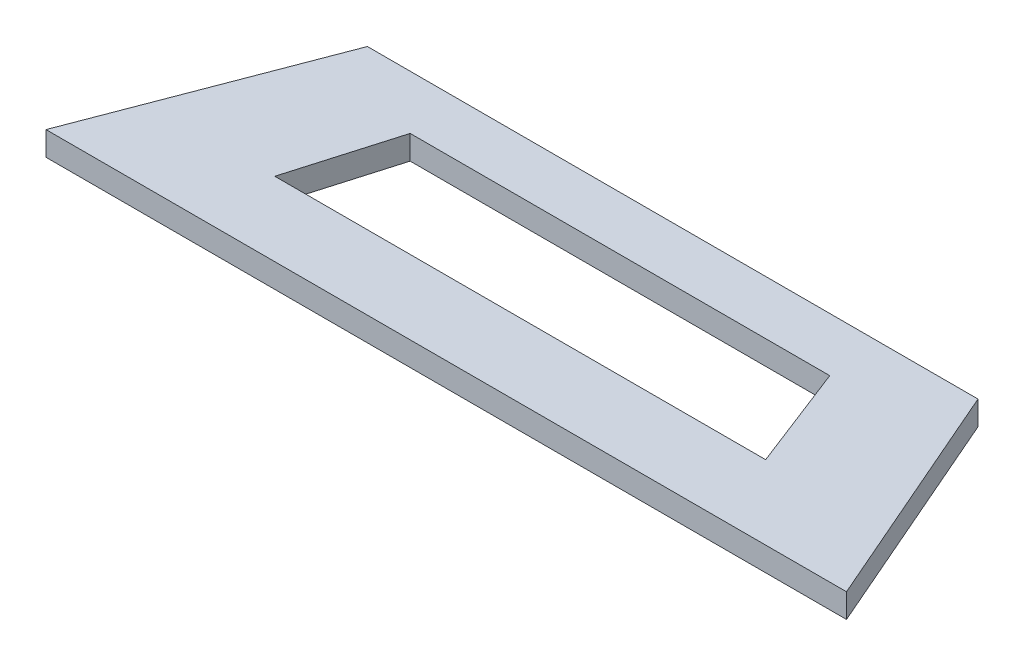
ISO-10303-21;
HEADER;
FILE_DESCRIPTION(('STEP AP214'),'2;1');
FILE_NAME('part.step','',(''),(''),'','','');
FILE_SCHEMA(('AUTOMOTIVE_DESIGN { 1 0 10303 214 1 1 1 1 }'));
ENDSEC;
DATA;
#1=APPLICATION_CONTEXT('core data for automotive mechanical design processes');
#2=APPLICATION_PROTOCOL_DEFINITION('international standard','automotive_design',2000,#1);
#3=PRODUCT_CONTEXT('',#1,'mechanical');
#4=PRODUCT('Part','Part','',(#3));
#5=PRODUCT_RELATED_PRODUCT_CATEGORY('part','',(#4));
#6=PRODUCT_DEFINITION_FORMATION('','',#4);
#7=PRODUCT_DEFINITION_CONTEXT('part definition',#1,'design');
#8=PRODUCT_DEFINITION('design','',#6,#7);
#9=PRODUCT_DEFINITION_SHAPE('','',#8);
#10=(LENGTH_UNIT() NAMED_UNIT(*) SI_UNIT(.MILLI.,.METRE.));
#11=(NAMED_UNIT(*) PLANE_ANGLE_UNIT() SI_UNIT($,.RADIAN.));
#12=(NAMED_UNIT(*) SI_UNIT($,.STERADIAN.) SOLID_ANGLE_UNIT());
#13=UNCERTAINTY_MEASURE_WITH_UNIT(LENGTH_MEASURE(1.E-05),#10,'distance_accuracy_value','');
#14=(GEOMETRIC_REPRESENTATION_CONTEXT(3) GLOBAL_UNCERTAINTY_ASSIGNED_CONTEXT((#13)) GLOBAL_UNIT_ASSIGNED_CONTEXT((#10,
#11,#12)) REPRESENTATION_CONTEXT('',''));
#15=CARTESIAN_POINT('',(0.,0.,0.));
#16=DIRECTION('',(0.,0.,1.));
#17=DIRECTION('',(1.,0.,0.));
#18=AXIS2_PLACEMENT_3D('',#15,#16,#17);
#19=CARTESIAN_POINT('',(11.0888777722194,3.,-29.0626794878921));
#20=DIRECTION('',(0.934301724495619,0.,0.356483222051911));
#21=DIRECTION('',(0.356483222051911,0.,-0.934301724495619));
#22=AXIS2_PLACEMENT_3D('',#19,#20,#21);
#23=PLANE('',#22);
#24=DIRECTION('',(-0.356483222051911,0.,0.934301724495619));
#25=VECTOR('',#24,1.);
#26=CARTESIAN_POINT('',(11.0888777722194,0.,-29.0626794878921));
#27=LINE('',#26,#25);
#28=CARTESIAN_POINT('',(11.0888777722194,0.,-29.0626794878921));
#29=VERTEX_POINT('',#28);
#30=CARTESIAN_POINT('',(0.,0.,0.));
#31=VERTEX_POINT('',#30);
#32=EDGE_CURVE('E120',#29,#31,#27,.T.);
#33=ORIENTED_EDGE('',*,*,#32,.T.);
#34=DIRECTION('',(0.,-1.,0.));
#35=VECTOR('',#34,1.);
#36=CARTESIAN_POINT('',(0.,3.,0.));
#37=LINE('',#36,#35);
#38=CARTESIAN_POINT('',(0.,3.,0.));
#39=VERTEX_POINT('',#38);
#40=EDGE_CURVE('E11',#39,#31,#37,.T.);
#41=ORIENTED_EDGE('',*,*,#40,.F.);
#42=DIRECTION('',(-0.356483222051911,0.,0.934301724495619));
#43=VECTOR('',#42,1.);
#44=CARTESIAN_POINT('',(11.0888777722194,3.,-29.0626794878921));
#45=LINE('',#44,#43);
#46=CARTESIAN_POINT('',(11.0888777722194,3.,-29.0626794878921));
#47=VERTEX_POINT('',#46);
#48=EDGE_CURVE('E152',#47,#39,#45,.T.);
#49=ORIENTED_EDGE('',*,*,#48,.F.);
#50=DIRECTION('',(0.,-1.,0.));
#51=VECTOR('',#50,1.);
#52=CARTESIAN_POINT('',(11.0888777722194,3.,-29.0626794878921));
#53=LINE('',#52,#51);
#54=EDGE_CURVE('E166',#47,#29,#53,.T.);
#55=ORIENTED_EDGE('',*,*,#54,.T.);
#56=EDGE_LOOP('',(#33,#41,#49,#55));
#57=FACE_BOUND('',#56,.T.);
#58=ADVANCED_FACE('F39',(#57),#23,.F.);
#59=CARTESIAN_POINT('',(0.,3.,0.));
#60=DIRECTION('',(0.,0.,-1.));
#61=DIRECTION('',(-1.,0.,0.));
#62=AXIS2_PLACEMENT_3D('',#59,#60,#61);
#63=PLANE('',#62);
#64=DIRECTION('',(1.,0.,0.));
#65=VECTOR('',#64,1.);
#66=CARTESIAN_POINT('',(0.,0.,0.));
#67=LINE('',#66,#65);
#68=CARTESIAN_POINT('',(100.,0.,0.));
#69=VERTEX_POINT('',#68);
#70=EDGE_CURVE('E170',#31,#69,#67,.T.);
#71=ORIENTED_EDGE('',*,*,#70,.T.);
#72=DIRECTION('',(0.,-1.,0.));
#73=VECTOR('',#72,1.);
#74=CARTESIAN_POINT('',(100.,3.,0.));
#75=LINE('',#74,#73);
#76=CARTESIAN_POINT('',(100.,3.,0.));
#77=VERTEX_POINT('',#76);
#78=EDGE_CURVE('E47',#77,#69,#75,.T.);
#79=ORIENTED_EDGE('',*,*,#78,.F.);
#80=DIRECTION('',(1.,0.,0.));
#81=VECTOR('',#80,1.);
#82=CARTESIAN_POINT('',(0.,3.,0.));
#83=LINE('',#82,#81);
#84=EDGE_CURVE('E156',#39,#77,#83,.T.);
#85=ORIENTED_EDGE('',*,*,#84,.F.);
#86=ORIENTED_EDGE('',*,*,#40,.T.);
#87=EDGE_LOOP('',(#71,#79,#85,#86));
#88=FACE_BOUND('',#87,.T.);
#89=ADVANCED_FACE('F204',(#88),#63,.F.);
#90=CARTESIAN_POINT('',(100.,3.,0.));
#91=DIRECTION('',(-0.917070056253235,0.,0.39872611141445));
#92=DIRECTION('',(0.398726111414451,0.,0.917070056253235));
#93=AXIS2_PLACEMENT_3D('',#90,#91,#92);
#94=PLANE('',#93);
#95=DIRECTION('',(-0.398726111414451,0.,-0.917070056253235));
#96=VECTOR('',#95,1.);
#97=CARTESIAN_POINT('',(100.,0.,0.));
#98=LINE('',#97,#96);
#99=CARTESIAN_POINT('',(87.3640523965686,0.,-29.0626794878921));
#100=VERTEX_POINT('',#99);
#101=EDGE_CURVE('E173',#69,#100,#98,.T.);
#102=ORIENTED_EDGE('',*,*,#101,.T.);
#103=DIRECTION('',(0.,-1.,0.));
#104=VECTOR('',#103,1.);
#105=CARTESIAN_POINT('',(87.3640523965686,3.,-29.0626794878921));
#106=LINE('',#105,#104);
#107=CARTESIAN_POINT('',(87.3640523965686,3.,-29.0626794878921));
#108=VERTEX_POINT('',#107);
#109=EDGE_CURVE('E181',#108,#100,#106,.T.);
#110=ORIENTED_EDGE('',*,*,#109,.F.);
#111=DIRECTION('',(-0.398726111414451,0.,-0.917070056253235));
#112=VECTOR('',#111,1.);
#113=CARTESIAN_POINT('',(100.,3.,0.));
#114=LINE('',#113,#112);
#115=EDGE_CURVE('E160',#77,#108,#114,.T.);
#116=ORIENTED_EDGE('',*,*,#115,.F.);
#117=ORIENTED_EDGE('',*,*,#78,.T.);
#118=EDGE_LOOP('',(#102,#110,#116,#117));
#119=FACE_BOUND('',#118,.T.);
#120=ADVANCED_FACE('F190',(#119),#94,.F.);
#121=CARTESIAN_POINT('',(87.3640523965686,3.,-29.0626794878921));
#122=DIRECTION('',(0.,0.,1.));
#123=DIRECTION('',(1.,0.,0.));
#124=AXIS2_PLACEMENT_3D('',#121,#122,#123);
#125=PLANE('',#124);
#126=DIRECTION('',(-1.,0.,0.));
#127=VECTOR('',#126,1.);
#128=CARTESIAN_POINT('',(87.3640523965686,0.,-29.0626794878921));
#129=LINE('',#128,#127);
#130=EDGE_CURVE('E157',#100,#29,#129,.T.);
#131=ORIENTED_EDGE('',*,*,#130,.T.);
#132=ORIENTED_EDGE('',*,*,#54,.F.);
#133=DIRECTION('',(-1.,0.,0.));
#134=VECTOR('',#133,1.);
#135=CARTESIAN_POINT('',(87.3640523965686,3.,-29.0626794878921));
#136=LINE('',#135,#134);
#137=EDGE_CURVE('E163',#108,#47,#136,.T.);
#138=ORIENTED_EDGE('',*,*,#137,.F.);
#139=ORIENTED_EDGE('',*,*,#109,.T.);
#140=EDGE_LOOP('',(#131,#132,#138,#139));
#141=FACE_BOUND('',#140,.T.);
#142=ADVANCED_FACE('F197',(#141),#125,.F.);
#143=CARTESIAN_POINT('',(0.,3.,0.));
#144=DIRECTION('',(0.,1.,0.));
#145=DIRECTION('',(0.,0.,1.));
#146=AXIS2_PLACEMENT_3D('',#143,#144,#145);
#147=PLANE('',#146);
#148=DIRECTION('',(-0.279999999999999,0.,0.96));
#149=VECTOR('',#148,1.);
#150=CARTESIAN_POINT('',(23.1583387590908,3.,-22.3328794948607));
#151=LINE('',#150,#149);
#152=CARTESIAN_POINT('',(23.1583387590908,3.,-22.3328794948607));
#153=VERTEX_POINT('',#152);
#154=CARTESIAN_POINT('',(19.3394032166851,3.,-9.23938620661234));
#155=VERTEX_POINT('',#154);
#156=EDGE_CURVE('E54',#153,#155,#151,.T.);
#157=ORIENTED_EDGE('',*,*,#156,.F.);
#158=DIRECTION('',(-1.,0.,0.));
#159=VECTOR('',#158,1.);
#160=CARTESIAN_POINT('',(75.5746944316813,3.,-22.3328794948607));
#161=LINE('',#160,#159);
#162=CARTESIAN_POINT('',(75.5746944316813,3.,-22.3328794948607));
#163=VERTEX_POINT('',#162);
#164=EDGE_CURVE('E113',#163,#153,#161,.T.);
#165=ORIENTED_EDGE('',*,*,#164,.F.);
#166=DIRECTION('',(-0.362074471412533,0.,-0.932149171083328));
#167=VECTOR('',#166,1.);
#168=CARTESIAN_POINT('',(80.660596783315,3.,-9.23938620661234));
#169=LINE('',#168,#167);
#170=CARTESIAN_POINT('',(80.660596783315,3.,-9.23938620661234));
#171=VERTEX_POINT('',#170);
#172=EDGE_CURVE('E138',#171,#163,#169,.T.);
#173=ORIENTED_EDGE('',*,*,#172,.F.);
#174=DIRECTION('',(1.,0.,0.));
#175=VECTOR('',#174,1.);
#176=CARTESIAN_POINT('',(60.9112444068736,3.,-9.23938620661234));
#177=LINE('',#176,#175);
#178=EDGE_CURVE('E131',#155,#171,#177,.T.);
#179=ORIENTED_EDGE('',*,*,#178,.F.);
#180=EDGE_LOOP('',(#157,#165,#173,#179));
#181=FACE_BOUND('',#180,.T.);
#182=ORIENTED_EDGE('',*,*,#48,.T.);
#183=ORIENTED_EDGE('',*,*,#84,.T.);
#184=ORIENTED_EDGE('',*,*,#115,.T.);
#185=ORIENTED_EDGE('',*,*,#137,.T.);
#186=EDGE_LOOP('',(#182,#183,#184,#185));
#187=FACE_BOUND('',#186,.T.);
#188=ADVANCED_FACE('F203',(#181,#187),#147,.T.);
#189=CARTESIAN_POINT('',(0.,0.,0.));
#190=DIRECTION('',(0.,1.,0.));
#191=DIRECTION('',(0.,0.,1.));
#192=AXIS2_PLACEMENT_3D('',#189,#190,#191);
#193=PLANE('',#192);
#194=DIRECTION('',(1.,0.,0.));
#195=VECTOR('',#194,1.);
#196=CARTESIAN_POINT('',(75.5746944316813,0.,-22.3328794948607));
#197=LINE('',#196,#195);
#198=CARTESIAN_POINT('',(23.1583387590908,0.,-22.3328794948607));
#199=VERTEX_POINT('',#198);
#200=CARTESIAN_POINT('',(75.5746944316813,0.,-22.3328794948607));
#201=VERTEX_POINT('',#200);
#202=EDGE_CURVE('E126',#199,#201,#197,.T.);
#203=ORIENTED_EDGE('',*,*,#202,.F.);
#204=DIRECTION('',(0.28,0.,-0.96));
#205=VECTOR('',#204,1.);
#206=CARTESIAN_POINT('',(23.1583387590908,0.,-22.3328794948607));
#207=LINE('',#206,#205);
#208=CARTESIAN_POINT('',(19.3394032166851,0.,-9.23938620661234));
#209=VERTEX_POINT('',#208);
#210=EDGE_CURVE('E106',#209,#199,#207,.T.);
#211=ORIENTED_EDGE('',*,*,#210,.F.);
#212=DIRECTION('',(-1.,0.,0.));
#213=VECTOR('',#212,1.);
#214=CARTESIAN_POINT('',(60.9112444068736,0.,-9.23938620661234));
#215=LINE('',#214,#213);
#216=CARTESIAN_POINT('',(80.660596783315,0.,-9.23938620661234));
#217=VERTEX_POINT('',#216);
#218=EDGE_CURVE('E116',#217,#209,#215,.T.);
#219=ORIENTED_EDGE('',*,*,#218,.F.);
#220=DIRECTION('',(0.362074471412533,0.,0.932149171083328));
#221=VECTOR('',#220,1.);
#222=CARTESIAN_POINT('',(80.660596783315,0.,-9.23938620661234));
#223=LINE('',#222,#221);
#224=EDGE_CURVE('E62',#201,#217,#223,.T.);
#225=ORIENTED_EDGE('',*,*,#224,.F.);
#226=EDGE_LOOP('',(#203,#211,#219,#225));
#227=FACE_BOUND('',#226,.T.);
#228=ORIENTED_EDGE('',*,*,#32,.F.);
#229=ORIENTED_EDGE('',*,*,#130,.F.);
#230=ORIENTED_EDGE('',*,*,#101,.F.);
#231=ORIENTED_EDGE('',*,*,#70,.F.);
#232=EDGE_LOOP('',(#228,#229,#230,#231));
#233=FACE_BOUND('',#232,.T.);
#234=ADVANCED_FACE('F123',(#227,#233),#193,.F.);
#235=CARTESIAN_POINT('',(23.1583387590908,-0.00100000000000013,-22.3328794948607));
#236=DIRECTION('',(-0.96,0.,-0.28));
#237=DIRECTION('',(-0.28,0.,0.96));
#238=AXIS2_PLACEMENT_3D('',#235,#236,#237);
#239=PLANE('',#238);
#240=ORIENTED_EDGE('',*,*,#210,.T.);
#241=DIRECTION('',(0.,1.,0.));
#242=VECTOR('',#241,1.);
#243=CARTESIAN_POINT('',(23.1583387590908,-0.00100000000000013,-22.3328794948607));
#244=LINE('',#243,#242);
#245=EDGE_CURVE('E121',#199,#153,#244,.T.);
#246=ORIENTED_EDGE('',*,*,#245,.T.);
#247=ORIENTED_EDGE('',*,*,#156,.T.);
#248=DIRECTION('',(0.,1.,0.));
#249=VECTOR('',#248,1.);
#250=CARTESIAN_POINT('',(19.3394032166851,-0.00100000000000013,-9.23938620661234));
#251=LINE('',#250,#249);
#252=EDGE_CURVE('E102',#209,#155,#251,.T.);
#253=ORIENTED_EDGE('',*,*,#252,.F.);
#254=EDGE_LOOP('',(#240,#246,#247,#253));
#255=FACE_BOUND('',#254,.T.);
#256=ADVANCED_FACE('F104',(#255),#239,.F.);
#257=CARTESIAN_POINT('',(75.5746944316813,-0.00100000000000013,-22.3328794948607));
#258=DIRECTION('',(0.,0.,-1.));
#259=DIRECTION('',(-1.,0.,0.));
#260=AXIS2_PLACEMENT_3D('',#257,#258,#259);
#261=PLANE('',#260);
#262=ORIENTED_EDGE('',*,*,#202,.T.);
#263=DIRECTION('',(0.,1.,0.));
#264=VECTOR('',#263,1.);
#265=CARTESIAN_POINT('',(75.5746944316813,-0.00100000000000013,-22.3328794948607));
#266=LINE('',#265,#264);
#267=EDGE_CURVE('E147',#201,#163,#266,.T.);
#268=ORIENTED_EDGE('',*,*,#267,.T.);
#269=ORIENTED_EDGE('',*,*,#164,.T.);
#270=ORIENTED_EDGE('',*,*,#245,.F.);
#271=EDGE_LOOP('',(#262,#268,#269,#270));
#272=FACE_BOUND('',#271,.T.);
#273=ADVANCED_FACE('F221',(#272),#261,.F.);
#274=CARTESIAN_POINT('',(80.660596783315,-0.00100000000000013,-9.23938620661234));
#275=DIRECTION('',(0.932149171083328,0.,-0.362074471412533));
#276=DIRECTION('',(-0.362074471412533,0.,-0.932149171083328));
#277=AXIS2_PLACEMENT_3D('',#274,#275,#276);
#278=PLANE('',#277);
#279=ORIENTED_EDGE('',*,*,#224,.T.);
#280=DIRECTION('',(0.,1.,0.));
#281=VECTOR('',#280,1.);
#282=CARTESIAN_POINT('',(80.660596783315,-0.00100000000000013,-9.23938620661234));
#283=LINE('',#282,#281);
#284=EDGE_CURVE('E112',#217,#171,#283,.T.);
#285=ORIENTED_EDGE('',*,*,#284,.T.);
#286=ORIENTED_EDGE('',*,*,#172,.T.);
#287=ORIENTED_EDGE('',*,*,#267,.F.);
#288=EDGE_LOOP('',(#279,#285,#286,#287));
#289=FACE_BOUND('',#288,.T.);
#290=ADVANCED_FACE('F224',(#289),#278,.F.);
#291=CARTESIAN_POINT('',(60.9112444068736,-0.00100000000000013,-9.23938620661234));
#292=DIRECTION('',(0.,0.,1.));
#293=DIRECTION('',(1.,0.,0.));
#294=AXIS2_PLACEMENT_3D('',#291,#292,#293);
#295=PLANE('',#294);
#296=ORIENTED_EDGE('',*,*,#218,.T.);
#297=ORIENTED_EDGE('',*,*,#252,.T.);
#298=ORIENTED_EDGE('',*,*,#178,.T.);
#299=ORIENTED_EDGE('',*,*,#284,.F.);
#300=EDGE_LOOP('',(#296,#297,#298,#299));
#301=FACE_BOUND('',#300,.T.);
#302=ADVANCED_FACE('F117',(#301),#295,.F.);
#303=CLOSED_SHELL('',(#58,#89,#120,#142,#188,#234,#256,#273,#290,#302));
#304=MANIFOLD_SOLID_BREP('B2',#303);
#305=ADVANCED_BREP_SHAPE_REPRESENTATION('',(#18,#304),#14);
#306=SHAPE_DEFINITION_REPRESENTATION(#9,#305);
ENDSEC;
END-ISO-10303-21;
